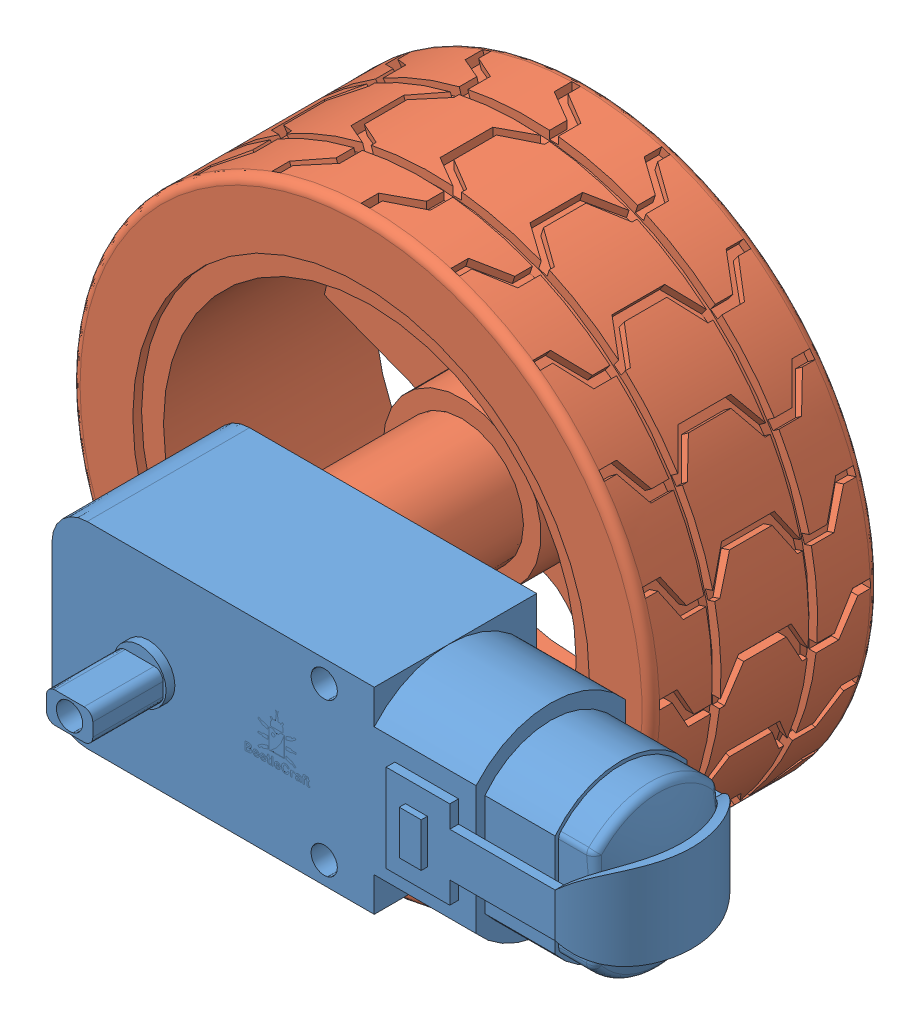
SolidWorks assembly MOTOR_WHEEL.sldasm, configuration Default (file format 10000). Lengths in mm.
Overall size (86.39 66 59.2).
2 component instances, 2 part files, 0 mates.
Components (placement in the parent):
- DC_MOTOR-1: DC_MOTOR.sldprt [Default] at (-47.4122 -5.0895 64.3884) size (64.39 22.4 36.5)
- WHEEL-1: WHEEL.sldprt [Default] at (-36.4141 -5.0866 58.6884) x (-1 0 0) z (0 0 -1) size (66 66 30.7)
